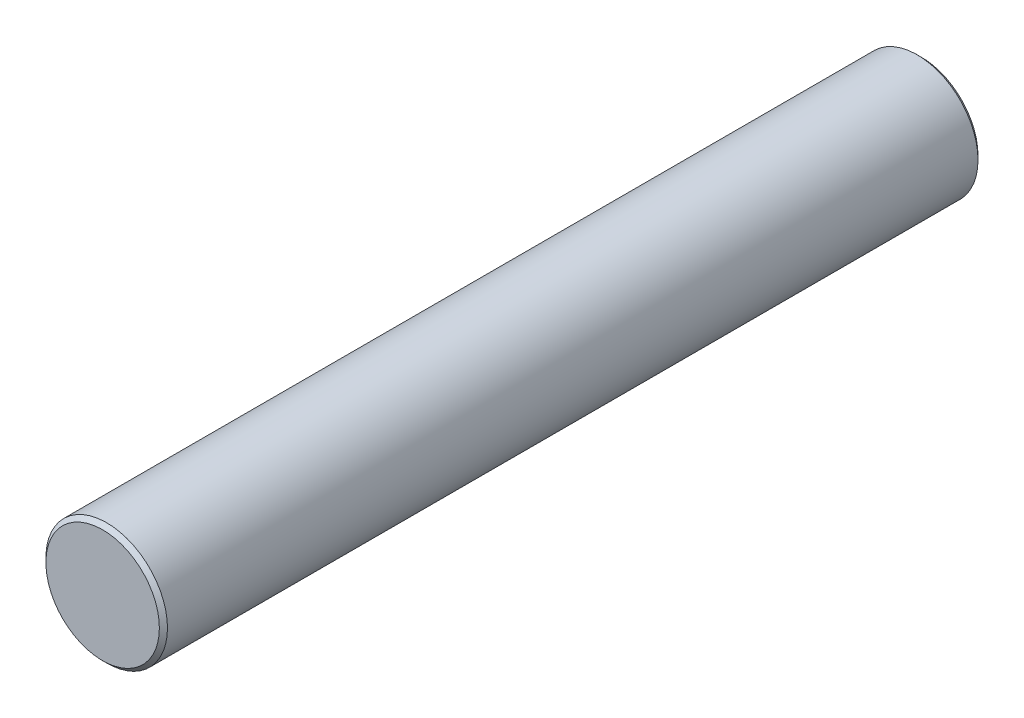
from build123d import *

# Parameters (mm, degrees)
ESQUISSE1_R      = 15
EXTRUSION1_DEPTH = 202
CHANFREIN1_SIZE  = 1


with BuildPart() as part:
    # Esquisse1 → Extrusion1 (new body)
    with BuildSketch(Plane.XY):
        Circle(ESQUISSE1_R)
    extrude(amount=EXTRUSION1_DEPTH)

    # Chanfrein1
    chanfrein1_edges = [part.edges().sort_by_distance(p)[0] for p in [
        (-15, 0, 0),
        (-15, 0, 202),
    ]]
    chamfer(chanfrein1_edges, length=CHANFREIN1_SIZE)


solid = part.part
